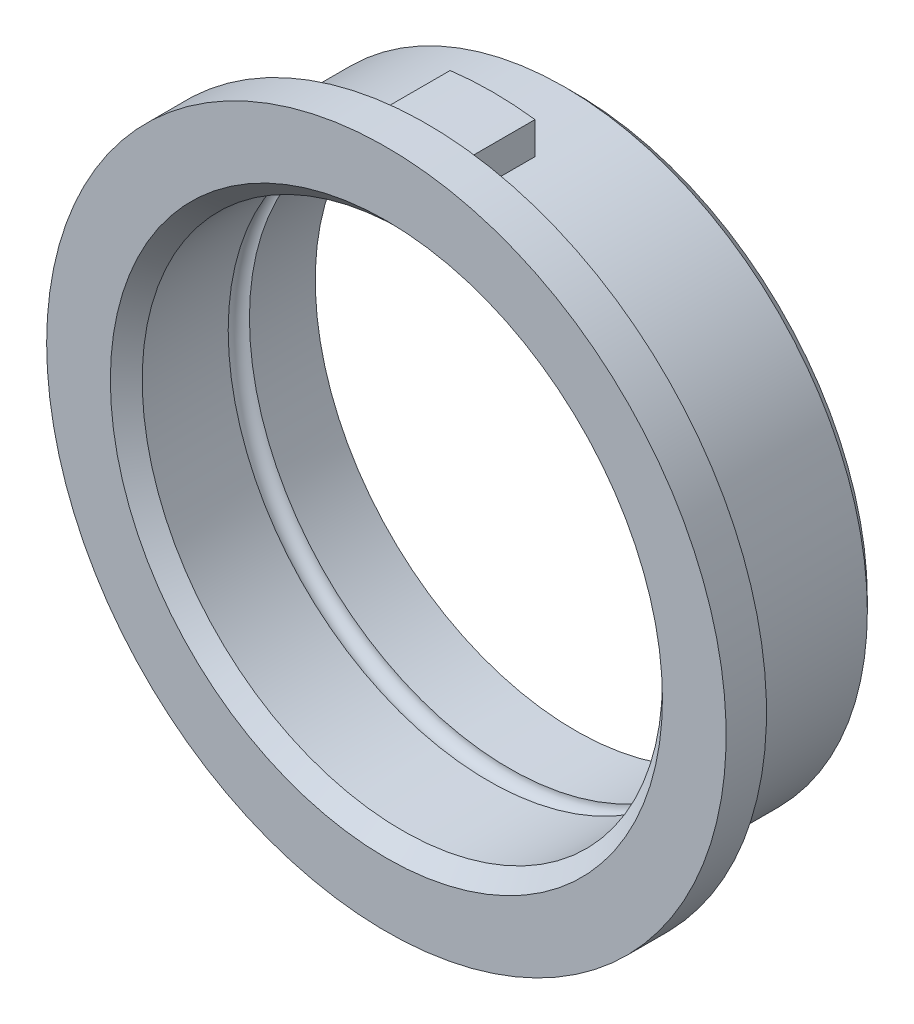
from build123d import *

# Parameters (mm, degrees)
ESQUISSE1_R          = 14.25
ESQUISSE1_R_2        = 12.25
BASE_EXTRUSION_DEPTH = 7
BOSS_EXTRU_1_START   = 1.9
ESQUISSE2_R          = 16
ESQUISSE2_R_2        = 12.25
BOSS_EXTRU_1_DEPTH   = 1.9
CHANFREIN1_SIZE      = 0.5
CHANFREIN2_SIZE      = 0.75
BOSS_EXTRU_2_DEPTH   = 3.1


with BuildPart() as part:
    # Esquisse1 → Base-Extrusion (new body)
    with BuildSketch(Plane.XY):
        with Locations((0, -31.75)):
            Circle(ESQUISSE1_R)
        with Locations((0, -31.75)):
            Circle(ESQUISSE1_R_2, mode=Mode.SUBTRACT)
    extrude(amount=-BASE_EXTRUSION_DEPTH)

    # Esquisse2 → Boss.-Extru.1 (add)
    with BuildSketch(Plane.XY.offset(BOSS_EXTRU_1_START)):
        with Locations(Location((0, -31.75, 0), (0, 0, 180))):
            Circle(ESQUISSE2_R)
        with Locations((0, -31.75)):
            Circle(ESQUISSE2_R_2, mode=Mode.SUBTRACT)
    extrude(amount=-BOSS_EXTRU_1_DEPTH)

    # Chanfrein1
    chanfrein1_edges = [part.edges().sort_by_distance(p)[0] for p in [
        (-14.25, -31.75, -7),
    ]]
    chamfer(chanfrein1_edges, length=CHANFREIN1_SIZE)

    # Chanfrein2
    chanfrein2_edges = [part.edges().sort_by_distance(p)[0] for p in [
        (-12.25, -31.75, 1.9),
    ]]
    chamfer(chanfrein2_edges, length=CHANFREIN2_SIZE)

    # Esquisse3 → Enl_vement de mati_re-R_volution1 (revolve, cut)
    with BuildSketch(Plane(origin=(0, 0, 0), x_dir=(0, 0, -1), z_dir=(1, 0, 0)), mode=Mode.PRIVATE) as enl_vement_de_mati_re_r_volution1_sk:
        with BuildLine():
            Line((3.4, -19.5), (3.9, -19.5))
            ThreePointArc((3.9, -19.5), (3.4, -19), (2.9, -19.5))
            Line((2.9, -19.5), (3.4, -19.5))
        make_face()
    revolve(enl_vement_de_mati_re_r_volution1_sk.sketch.rotate(Axis((0, -31.75, -8.34335423), (0, 0, 1)), 270), axis=Axis((0, -31.75, -8.34335423), (0, 0, 1)), mode=Mode.SUBTRACT)

    # Esquisse4 → Boss.-Extru.2 (add)
    with BuildSketch(Plane(origin=(0, 0, 0), x_dir=(-1, 0, 0), z_dir=(0, 0, -1))):
        with BuildLine():
            Line((2, -16.1275002), (2, -17.64104894))
            ThreePointArc((2, -17.64104894), (0, -17.5), (-2, -17.64104894))
            Line((-2, -17.64104894), (-2, -16.1275002))
            ThreePointArc((-2, -16.1275002), (0, -16), (2, -16.1275002))
        make_face()
    extrude(amount=BOSS_EXTRU_2_DEPTH)


solid = part.part
